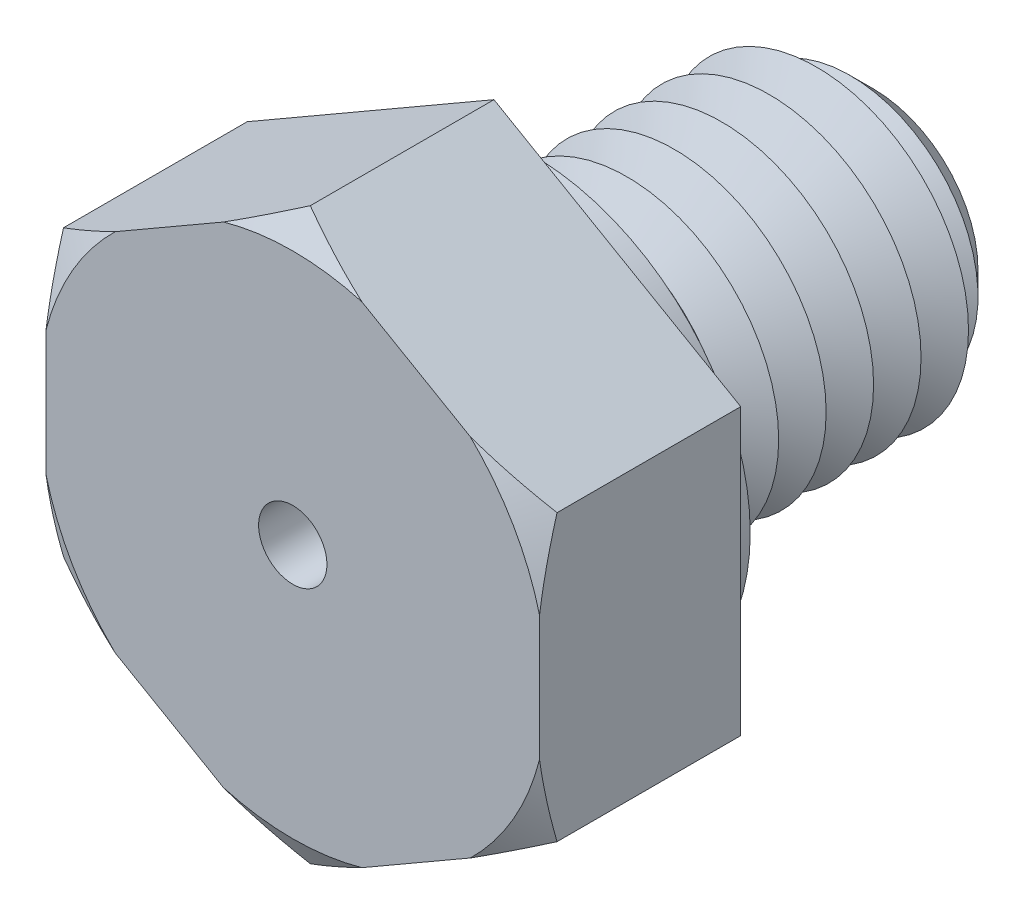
from build123d import *

# Parameters (mm, degrees)
BOSS_EXTRUDE1_DEPTH = 5.3
SKETCH3_R           = 4
BOSS_EXTRUDE2_DEPTH = 10
SKETCH4_R           = 5.75
BOSS_EXTRUDE3_DEPTH = 1
CHAMFER1_SIZE       = 1.25
LPATTERN1_COUNT     = 7
LPATTERN1_PITCH     = 1.25
SKETCH8_R           = 0.9
CUT_EXTRUDE1_DEPTH  = 15.3


with BuildPart() as part:
    # Sketch2 → Boss-Extrude1 (new body)
    with BuildSketch(Plane.XY):
        Polygon((0, 7.505553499), (-6.5, 3.75277675), (-6.5, -3.75277675), (0, -7.505553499), (6.5, -3.75277675), (6.5, 3.75277675), align=None)
    extrude(amount=BOSS_EXTRUDE1_DEPTH)

    # Sketch3 → Boss-Extrude2 (add)
    with BuildSketch(Plane(origin=(0, 0, 0), x_dir=(-1, 0, 0), z_dir=(0, 0, -1))):
        Circle(SKETCH3_R)
    extrude(amount=BOSS_EXTRUDE2_DEPTH)

    # Sketch4 → Boss-Extrude3 (add)
    with BuildSketch(Plane(origin=(0, 0, 0), x_dir=(-1, 0, 0), z_dir=(0, 0, -1))):
        with Locations(Location((0, 0, 0), (0, 0, 180))):
            Circle(SKETCH4_R)
    extrude(amount=BOSS_EXTRUDE3_DEPTH)

    # Chamfer1
    chamfer1_edges = [part.edges().sort_by_distance(p)[0] for p in [
        (4, 0, -10),
    ]]
    chamfer(chamfer1_edges, length=CHAMFER1_SIZE)

    # Sketch6 → Cut-Revolve1 (revolve, cut)
    with BuildSketch(Plane(origin=(0, 0, 0), x_dir=(0, 0, -1), z_dir=(1, 0, 0)), mode=Mode.PRIVATE) as cut_revolve1_sk:
        Polygon((1, 4), (1.625, 2.917468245), (2.25, 4), align=None)
    cut_revolve1 = revolve(cut_revolve1_sk.sketch.rotate(Axis((0, 0, 3.211670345), (0, 0, -1)), 90), axis=Axis((0, 0, 3.211670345), (0, 0, -1)), mode=Mode.SUBTRACT)

    # LPattern1: Cut-Revolve1 ×7
    with Locations(*[(0, 0, -i * LPATTERN1_PITCH) for i in range(1, LPATTERN1_COUNT)]):
        add(cut_revolve1, mode=Mode.SUBTRACT)

    # Sketch7 → Cut-Revolve2 (revolve, cut)
    with BuildSketch(Plane(origin=(0, 0, 0), x_dir=(0, 0, -1), z_dir=(1, 0, 0)), mode=Mode.PRIVATE) as cut_revolve2_sk:
        Polygon((-5.3, 7.505553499), (-5.3, 6.705553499), (-4.838119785, 7.505553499), align=None)
    revolve(cut_revolve2_sk.sketch.rotate(Axis((0, 0, 3.211670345), (0, 0, -1)), 270), axis=Axis((0, 0, 3.211670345), (0, 0, -1)), mode=Mode.SUBTRACT)

    # Sketch8 → Cut-Extrude1 (cut)
    with BuildSketch(Plane.XY.offset(5.3)):
        Circle(SKETCH8_R)
    extrude(amount=-CUT_EXTRUDE1_DEPTH, mode=Mode.SUBTRACT)


solid = part.part
